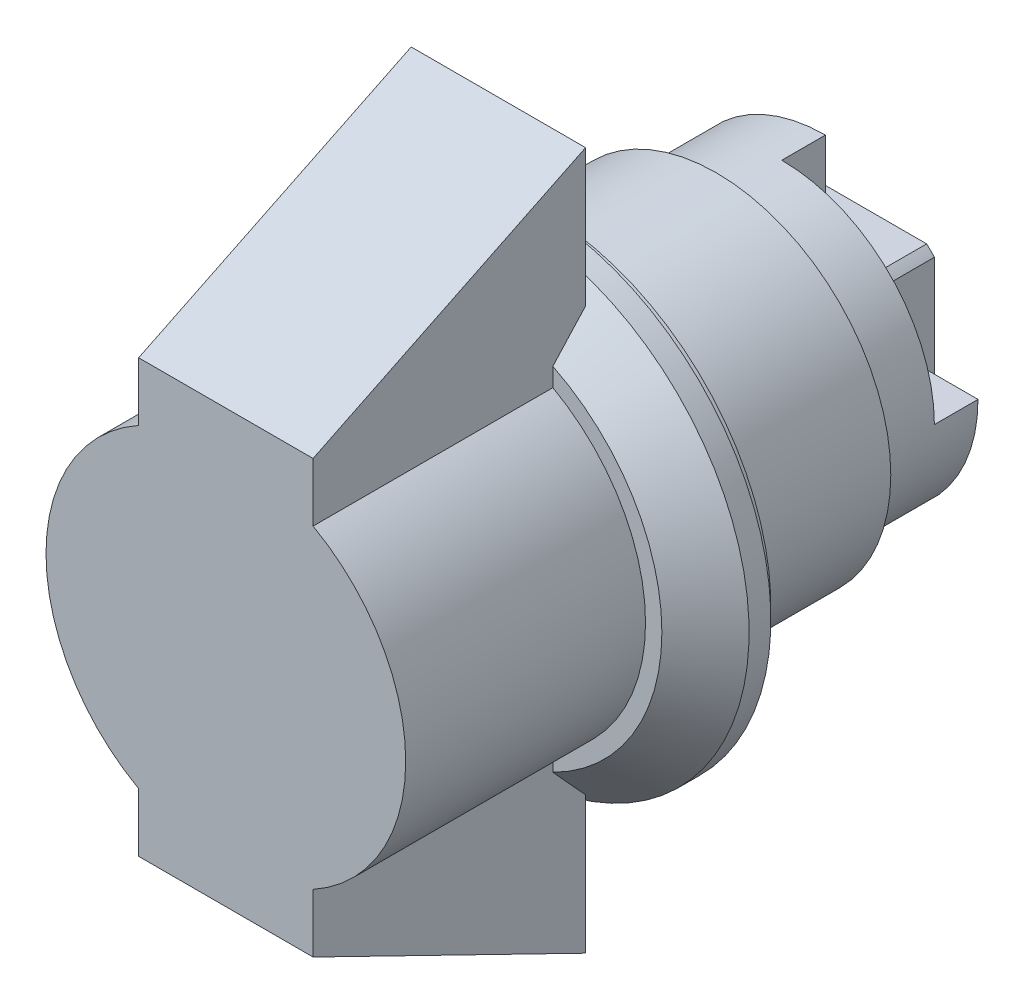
ISO-10303-21;
HEADER;
FILE_DESCRIPTION(('STEP AP214'),'2;1');
FILE_NAME('part.step','',(''),(''),'','','');
FILE_SCHEMA(('AUTOMOTIVE_DESIGN { 1 0 10303 214 1 1 1 1 }'));
ENDSEC;
DATA;
#1=APPLICATION_CONTEXT('core data for automotive mechanical design processes');
#2=APPLICATION_PROTOCOL_DEFINITION('international standard','automotive_design',2000,#1);
#3=PRODUCT_CONTEXT('',#1,'mechanical');
#4=PRODUCT('Part','Part','',(#3));
#5=PRODUCT_RELATED_PRODUCT_CATEGORY('part','',(#4));
#6=PRODUCT_DEFINITION_FORMATION('','',#4);
#7=PRODUCT_DEFINITION_CONTEXT('part definition',#1,'design');
#8=PRODUCT_DEFINITION('design','',#6,#7);
#9=PRODUCT_DEFINITION_SHAPE('','',#8);
#10=(LENGTH_UNIT() NAMED_UNIT(*) SI_UNIT(.MILLI.,.METRE.));
#11=(NAMED_UNIT(*) PLANE_ANGLE_UNIT() SI_UNIT($,.RADIAN.));
#12=(NAMED_UNIT(*) SI_UNIT($,.STERADIAN.) SOLID_ANGLE_UNIT());
#13=UNCERTAINTY_MEASURE_WITH_UNIT(LENGTH_MEASURE(1.E-05),#10,'distance_accuracy_value','');
#14=(GEOMETRIC_REPRESENTATION_CONTEXT(3) GLOBAL_UNCERTAINTY_ASSIGNED_CONTEXT((#13)) GLOBAL_UNIT_ASSIGNED_CONTEXT((#10,
#11,#12)) REPRESENTATION_CONTEXT('',''));
#15=CARTESIAN_POINT('',(0.,0.,0.));
#16=DIRECTION('',(0.,0.,1.));
#17=DIRECTION('',(1.,0.,0.));
#18=AXIS2_PLACEMENT_3D('',#15,#16,#17);
#19=CARTESIAN_POINT('',(0.,9.,3.5));
#20=DIRECTION('',(0.,0.,1.));
#21=DIRECTION('',(1.,0.,0.));
#22=AXIS2_PLACEMENT_3D('',#19,#20,#21);
#23=PLANE('',#22);
#24=CARTESIAN_POINT('',(0.,0.,3.5));
#25=DIRECTION('',(0.,0.,-1.));
#26=DIRECTION('',(-1.,0.,0.));
#27=AXIS2_PLACEMENT_3D('',#24,#25,#26);
#28=CIRCLE('',#27,9.);
#29=CARTESIAN_POINT('',(-4.,-8.06225774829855,3.5));
#30=VERTEX_POINT('',#29);
#31=CARTESIAN_POINT('',(-4.,8.06225774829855,3.5));
#32=VERTEX_POINT('',#31);
#33=EDGE_CURVE('E364',#30,#32,#28,.T.);
#34=ORIENTED_EDGE('',*,*,#33,.F.);
#35=DIRECTION('',(0.,1.,0.));
#36=VECTOR('',#35,1.);
#37=CARTESIAN_POINT('',(-4.,9.,3.5));
#38=LINE('',#37,#36);
#39=CARTESIAN_POINT('',(-4.,-7.21543484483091,3.5));
#40=VERTEX_POINT('',#39);
#41=EDGE_CURVE('E261',#30,#40,#38,.T.);
#42=ORIENTED_EDGE('',*,*,#41,.T.);
#43=CARTESIAN_POINT('',(0.,0.,3.5));
#44=DIRECTION('',(0.,0.,1.));
#45=DIRECTION('',(1.,0.,0.));
#46=AXIS2_PLACEMENT_3D('',#43,#44,#45);
#47=CIRCLE('',#46,8.25);
#48=CARTESIAN_POINT('',(-4.,7.21543484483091,3.5));
#49=VERTEX_POINT('',#48);
#50=EDGE_CURVE('E280',#49,#40,#47,.T.);
#51=ORIENTED_EDGE('',*,*,#50,.F.);
#52=EDGE_CURVE('E257',#49,#32,#38,.T.);
#53=ORIENTED_EDGE('',*,*,#52,.T.);
#54=EDGE_LOOP('',(#34,#42,#51,#53));
#55=FACE_BOUND('',#54,.T.);
#56=ADVANCED_FACE('F14',(#55),#23,.T.);
#57=CARTESIAN_POINT('',(0.,0.,1.5));
#58=DIRECTION('',(0.,0.,-1.));
#59=DIRECTION('',(-1.,0.,0.));
#60=AXIS2_PLACEMENT_3D('',#57,#58,#59);
#61=CONICAL_SURFACE('',#60,11.,0.785398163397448);
#62=CARTESIAN_POINT('',(0.,0.,1.5));
#63=DIRECTION('',(0.,0.,-1.));
#64=DIRECTION('',(-1.,0.,0.));
#65=AXIS2_PLACEMENT_3D('',#62,#63,#64);
#66=CIRCLE('',#65,11.);
#67=CARTESIAN_POINT('',(-11.,0.,1.5));
#68=VERTEX_POINT('',#67);
#69=EDGE_CURVE('E361',#68,#68,#66,.T.);
#70=ORIENTED_EDGE('',*,*,#69,.F.);
#71=EDGE_LOOP('',(#70));
#72=FACE_BOUND('',#71,.T.);
#73=CARTESIAN_POINT('',(0.,0.,2.));
#74=DIRECTION('',(0.,0.,1.));
#75=DIRECTION('',(1.,0.,0.));
#76=AXIS2_PLACEMENT_3D('',#73,#74,#75);
#77=CIRCLE('',#76,10.5);
#78=CARTESIAN_POINT('',(4.,-9.70824391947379,2.));
#79=VERTEX_POINT('',#78);
#80=CARTESIAN_POINT('',(-4.,-9.70824391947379,2.));
#81=VERTEX_POINT('',#80);
#82=EDGE_CURVE('E9',#79,#81,#77,.F.);
#83=ORIENTED_EDGE('',*,*,#82,.T.);
#84=CARTESIAN_POINT('',(-4.,-17.858105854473,-5.80059957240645));
#85=CARTESIAN_POINT('',(-4.,-17.5045819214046,-5.45563303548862));
#86=CARTESIAN_POINT('',(-4.,-17.1508222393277,-5.11090767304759));
#87=CARTESIAN_POINT('',(-4.,-16.4427152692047,-4.42205863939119));
#88=CARTESIAN_POINT('',(-4.,-16.0883679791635,-4.07793497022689));
#89=CARTESIAN_POINT('',(-4.,-15.3789386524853,-3.39037860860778));
#90=CARTESIAN_POINT('',(-4.,-15.0238565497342,-3.04694598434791));
#91=CARTESIAN_POINT('',(-4.,-14.3128340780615,-2.36097102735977));
#92=CARTESIAN_POINT('',(-4.,-13.9568937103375,-2.01842869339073));
#93=CARTESIAN_POINT('',(-4.,-13.2441762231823,-1.33467000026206));
#94=CARTESIAN_POINT('',(-4.,-12.8873997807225,-0.993452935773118));
#95=CARTESIAN_POINT('',(-4.,-12.1725099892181,-0.312422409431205));
#96=CARTESIAN_POINT('',(-4.,-11.8143966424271,0.0273910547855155));
#97=CARTESIAN_POINT('',(-4.,-11.0964623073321,0.705193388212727));
#98=CARTESIAN_POINT('',(-4.,-10.7366413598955,1.04318230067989));
#99=CARTESIAN_POINT('',(-4.,-10.0147552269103,1.71675339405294));
#100=CARTESIAN_POINT('',(-4.,-9.65269005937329,2.05233559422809));
#101=CARTESIAN_POINT('',(-4.,-9.01353072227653,2.63937643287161));
#102=CARTESIAN_POINT('',(-4.,-8.73708131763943,2.89153667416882));
#103=CARTESIAN_POINT('',(-4.,-8.18196173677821,3.393388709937));
#104=CARTESIAN_POINT('',(-4.,-7.90329163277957,3.64308058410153));
#105=CARTESIAN_POINT('',(-4.,-7.48306908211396,4.01518340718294));
#106=CARTESIAN_POINT('',(-4.,-7.34260789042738,4.13882693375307));
#107=CARTESIAN_POINT('',(-4.,-7.06084268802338,4.38514840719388));
#108=CARTESIAN_POINT('',(-4.,-6.91953868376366,4.50782636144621));
#109=CARTESIAN_POINT('',(-4.,-6.63594093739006,4.75206475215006));
#110=CARTESIAN_POINT('',(-4.,-6.49364709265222,4.87362506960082));
#111=CARTESIAN_POINT('',(-4.,-6.20790981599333,5.11539401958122));
#112=CARTESIAN_POINT('',(-4.,-6.06446635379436,5.23560261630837));
#113=CARTESIAN_POINT('',(-4.,-5.92036455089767,5.3550215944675));
#114=B_SPLINE_CURVE_WITH_KNOTS('',3,(#84,#85,#86,#87,#88,#89,#90,#91,#92,#93,#94,#95,#96,#97,
#98,#99,#100,#101,#102,#103,#104,#105,#106,#107,#108,#109,#110,#111,#112,#113),.UNSPECIFIED.,
.F.,.F.,(4,2,2,2,2,2,2,2,2,2,2,2,2,2,4),(0.,1.48183356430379,2.96367217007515,4.4456504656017,
5.92762669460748,7.4086594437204,8.88968969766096,10.3706846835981,11.8516677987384,
12.9741912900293,14.096678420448,14.65806033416,15.2194379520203,15.7808746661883,
16.342326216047),.UNSPECIFIED.);
#115=EDGE_CURVE('E270',#81,#30,#114,.T.);
#116=ORIENTED_EDGE('',*,*,#115,.T.);
#117=ORIENTED_EDGE('',*,*,#33,.T.);
#118=CARTESIAN_POINT('',(-4.,4.95832906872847,6.12936210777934));
#119=CARTESIAN_POINT('',(-4.,5.0787522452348,6.03562448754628));
#120=CARTESIAN_POINT('',(-4.,5.19853087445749,5.94106574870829));
#121=CARTESIAN_POINT('',(-4.,5.4369516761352,5.75053505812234));
#122=CARTESIAN_POINT('',(-4.,5.55559389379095,5.65456316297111));
#123=CARTESIAN_POINT('',(-4.,5.91001886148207,5.36489288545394));
#124=CARTESIAN_POINT('',(-4.,6.1443409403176,5.16940774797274));
#125=CARTESIAN_POINT('',(-4.,6.60990240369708,4.77500447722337));
#126=CARTESIAN_POINT('',(-4.,6.84114299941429,4.57608776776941));
#127=CARTESIAN_POINT('',(-4.,7.30130144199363,4.17556663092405));
#128=CARTESIAN_POINT('',(-4.,7.53021917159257,3.97396206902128));
#129=CARTESIAN_POINT('',(-4.,8.07664549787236,3.48829360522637));
#130=CARTESIAN_POINT('',(-4.,8.39327574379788,3.20324257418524));
#131=CARTESIAN_POINT('',(-4.,9.02386780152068,2.63020089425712));
#132=CARTESIAN_POINT('',(-4.,9.33782956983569,2.34221019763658));
#133=CARTESIAN_POINT('',(-4.,9.96372975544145,1.76400621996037));
#134=CARTESIAN_POINT('',(-4.,10.2756680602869,1.47379281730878));
#135=CARTESIAN_POINT('',(-4.,10.8979564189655,0.891667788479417));
#136=CARTESIAN_POINT('',(-4.,11.2083064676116,0.599756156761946));
#137=CARTESIAN_POINT('',(-4.,11.8281093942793,0.014254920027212));
#138=CARTESIAN_POINT('',(-4.,12.137560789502,-0.27933625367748));
#139=CARTESIAN_POINT('',(-4.,12.7554449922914,-0.867589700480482));
#140=CARTESIAN_POINT('',(-4.,13.0638777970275,-1.16225197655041));
#141=CARTESIAN_POINT('',(-4.,13.6798518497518,-1.75238711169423));
#142=CARTESIAN_POINT('',(-4.,13.9873932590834,-2.04785980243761));
#143=CARTESIAN_POINT('',(-4.,14.6017794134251,-2.63952462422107));
#144=CARTESIAN_POINT('',(-4.,14.9086241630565,-2.93571675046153));
#145=CARTESIAN_POINT('',(-4.,15.2151900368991,-3.23219653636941));
#146=B_SPLINE_CURVE_WITH_KNOTS('',3,(#118,#119,#120,#121,#122,#123,#124,#125,#126,#127,#128,
#129,#130,#131,#132,#133,#134,#135,#136,#137,#138,#139,#140,#141,#142,#143,#144,#145),
.UNSPECIFIED.,.F.,.F.,(4,2,2,2,2,2,2,2,2,2,2,2,2,4),(0.,0.457806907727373,0.915595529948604,
1.83101644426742,2.74606625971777,3.66116204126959,4.93925035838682,6.21735946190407,
7.49553899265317,8.77372269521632,10.0534083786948,11.3330976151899,12.6125386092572,
13.8919710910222),.UNSPECIFIED.);
#147=CARTESIAN_POINT('',(-4.,9.70824391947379,2.));
#148=VERTEX_POINT('',#147);
#149=EDGE_CURVE('E260',#32,#148,#146,.T.);
#150=ORIENTED_EDGE('',*,*,#149,.T.);
#151=CARTESIAN_POINT('',(4.,9.70824391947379,2.));
#152=VERTEX_POINT('',#151);
#153=EDGE_CURVE('E18',#148,#152,#77,.F.);
#154=ORIENTED_EDGE('',*,*,#153,.T.);
#155=CARTESIAN_POINT('',(4.,4.95832906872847,6.12936210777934));
#156=CARTESIAN_POINT('',(4.,5.0787522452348,6.03562448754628));
#157=CARTESIAN_POINT('',(4.,5.19853087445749,5.94106574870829));
#158=CARTESIAN_POINT('',(4.,5.4369516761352,5.75053505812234));
#159=CARTESIAN_POINT('',(4.,5.55559389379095,5.65456316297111));
#160=CARTESIAN_POINT('',(4.,5.91001886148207,5.36489288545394));
#161=CARTESIAN_POINT('',(4.,6.1443409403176,5.16940774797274));
#162=CARTESIAN_POINT('',(4.,6.60990240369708,4.77500447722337));
#163=CARTESIAN_POINT('',(4.,6.84114299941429,4.57608776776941));
#164=CARTESIAN_POINT('',(4.,7.30130144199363,4.17556663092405));
#165=CARTESIAN_POINT('',(4.,7.53021917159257,3.97396206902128));
#166=CARTESIAN_POINT('',(4.,8.07664549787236,3.48829360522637));
#167=CARTESIAN_POINT('',(4.,8.39327574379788,3.20324257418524));
#168=CARTESIAN_POINT('',(4.,9.02386780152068,2.63020089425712));
#169=CARTESIAN_POINT('',(4.,9.33782956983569,2.34221019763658));
#170=CARTESIAN_POINT('',(4.,9.96372975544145,1.76400621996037));
#171=CARTESIAN_POINT('',(4.,10.2756680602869,1.47379281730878));
#172=CARTESIAN_POINT('',(4.,10.8979564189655,0.891667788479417));
#173=CARTESIAN_POINT('',(4.,11.2083064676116,0.599756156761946));
#174=CARTESIAN_POINT('',(4.,11.8281093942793,0.014254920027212));
#175=CARTESIAN_POINT('',(4.,12.137560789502,-0.27933625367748));
#176=CARTESIAN_POINT('',(4.,12.7554449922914,-0.867589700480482));
#177=CARTESIAN_POINT('',(4.,13.0638777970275,-1.16225197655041));
#178=CARTESIAN_POINT('',(4.,13.6798518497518,-1.75238711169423));
#179=CARTESIAN_POINT('',(4.,13.9873932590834,-2.04785980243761));
#180=CARTESIAN_POINT('',(4.,14.6017794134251,-2.63952462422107));
#181=CARTESIAN_POINT('',(4.,14.9086241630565,-2.93571675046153));
#182=CARTESIAN_POINT('',(4.,15.2151900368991,-3.23219653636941));
#183=B_SPLINE_CURVE_WITH_KNOTS('',3,(#155,#156,#157,#158,#159,#160,#161,#162,#163,#164,#165,
#166,#167,#168,#169,#170,#171,#172,#173,#174,#175,#176,#177,#178,#179,#180,#181,#182),
.UNSPECIFIED.,.F.,.F.,(4,2,2,2,2,2,2,2,2,2,2,2,2,4),(0.,0.457806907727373,0.915595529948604,
1.83101644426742,2.74606625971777,3.66116204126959,4.93925035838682,6.21735946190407,
7.49553899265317,8.77372269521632,10.0534083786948,11.3330976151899,12.6125386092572,
13.8919710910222),.UNSPECIFIED.);
#184=CARTESIAN_POINT('',(4.,8.06225774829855,3.5));
#185=VERTEX_POINT('',#184);
#186=EDGE_CURVE('E226',#185,#152,#183,.T.);
#187=ORIENTED_EDGE('',*,*,#186,.F.);
#188=CARTESIAN_POINT('',(4.,-8.06225774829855,3.5));
#189=VERTEX_POINT('',#188);
#190=EDGE_CURVE('E367',#185,#189,#28,.T.);
#191=ORIENTED_EDGE('',*,*,#190,.T.);
#192=CARTESIAN_POINT('',(4.,-17.858105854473,-5.80059957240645));
#193=CARTESIAN_POINT('',(4.,-17.5045819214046,-5.45563303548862));
#194=CARTESIAN_POINT('',(4.,-17.1508222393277,-5.11090767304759));
#195=CARTESIAN_POINT('',(4.,-16.4427152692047,-4.42205863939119));
#196=CARTESIAN_POINT('',(4.,-16.0883679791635,-4.07793497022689));
#197=CARTESIAN_POINT('',(4.,-15.3789386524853,-3.39037860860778));
#198=CARTESIAN_POINT('',(4.,-15.0238565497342,-3.04694598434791));
#199=CARTESIAN_POINT('',(4.,-14.3128340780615,-2.36097102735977));
#200=CARTESIAN_POINT('',(4.,-13.9568937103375,-2.01842869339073));
#201=CARTESIAN_POINT('',(4.,-13.2441762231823,-1.33467000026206));
#202=CARTESIAN_POINT('',(4.,-12.8873997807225,-0.993452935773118));
#203=CARTESIAN_POINT('',(4.,-12.1725099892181,-0.312422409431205));
#204=CARTESIAN_POINT('',(4.,-11.8143966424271,0.0273910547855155));
#205=CARTESIAN_POINT('',(4.,-11.0964623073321,0.705193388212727));
#206=CARTESIAN_POINT('',(4.,-10.7366413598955,1.04318230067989));
#207=CARTESIAN_POINT('',(4.,-10.0147552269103,1.71675339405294));
#208=CARTESIAN_POINT('',(4.,-9.65269005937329,2.05233559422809));
#209=CARTESIAN_POINT('',(4.,-9.01353072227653,2.63937643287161));
#210=CARTESIAN_POINT('',(4.,-8.73708131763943,2.89153667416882));
#211=CARTESIAN_POINT('',(4.,-8.18196173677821,3.393388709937));
#212=CARTESIAN_POINT('',(4.,-7.90329163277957,3.64308058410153));
#213=CARTESIAN_POINT('',(4.,-7.48306908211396,4.01518340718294));
#214=CARTESIAN_POINT('',(4.,-7.34260789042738,4.13882693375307));
#215=CARTESIAN_POINT('',(4.,-7.06084268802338,4.38514840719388));
#216=CARTESIAN_POINT('',(4.,-6.91953868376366,4.50782636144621));
#217=CARTESIAN_POINT('',(4.,-6.63594093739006,4.75206475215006));
#218=CARTESIAN_POINT('',(4.,-6.49364709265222,4.87362506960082));
#219=CARTESIAN_POINT('',(4.,-6.20790981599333,5.11539401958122));
#220=CARTESIAN_POINT('',(4.,-6.06446635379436,5.23560261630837));
#221=CARTESIAN_POINT('',(4.,-5.92036455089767,5.3550215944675));
#222=B_SPLINE_CURVE_WITH_KNOTS('',3,(#192,#193,#194,#195,#196,#197,#198,#199,#200,#201,#202,
#203,#204,#205,#206,#207,#208,#209,#210,#211,#212,#213,#214,#215,#216,#217,#218,#219,#220,#221),
.UNSPECIFIED.,.F.,.F.,(4,2,2,2,2,2,2,2,2,2,2,2,2,2,4),(0.,1.48183356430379,2.96367217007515,
4.4456504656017,5.92762669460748,7.4086594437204,8.88968969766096,10.3706846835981,
11.8516677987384,12.9741912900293,14.096678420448,14.65806033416,15.2194379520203,
15.7808746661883,16.342326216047),.UNSPECIFIED.);
#223=EDGE_CURVE('E249',#79,#189,#222,.T.);
#224=ORIENTED_EDGE('',*,*,#223,.F.);
#225=EDGE_LOOP('',(#83,#116,#117,#150,#154,#187,#191,#224));
#226=FACE_BOUND('',#225,.T.);
#227=ADVANCED_FACE('F236',(#72,#226),#61,.T.);
#228=CARTESIAN_POINT('',(0.,0.,14.5));
#229=DIRECTION('',(0.,0.,-1.));
#230=DIRECTION('',(-1.,0.,0.));
#231=AXIS2_PLACEMENT_3D('',#228,#229,#230);
#232=CYLINDRICAL_SURFACE('',#231,8.25);
#233=DIRECTION('',(0.,0.,-1.));
#234=VECTOR('',#233,1.);
#235=CARTESIAN_POINT('',(-4.,-7.21543484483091,14.5));
#236=LINE('',#235,#234);
#237=CARTESIAN_POINT('',(-4.,-7.21543484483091,14.5));
#238=VERTEX_POINT('',#237);
#239=EDGE_CURVE('E268',#238,#40,#236,.T.);
#240=ORIENTED_EDGE('',*,*,#239,.F.);
#241=CARTESIAN_POINT('',(0.,0.,14.5));
#242=DIRECTION('',(0.,0.,1.));
#243=DIRECTION('',(1.,0.,0.));
#244=AXIS2_PLACEMENT_3D('',#241,#242,#243);
#245=CIRCLE('',#244,8.25);
#246=CARTESIAN_POINT('',(-4.,7.21543484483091,14.5));
#247=VERTEX_POINT('',#246);
#248=EDGE_CURVE('E283',#247,#238,#245,.T.);
#249=ORIENTED_EDGE('',*,*,#248,.F.);
#250=DIRECTION('',(0.,0.,-1.));
#251=VECTOR('',#250,1.);
#252=CARTESIAN_POINT('',(-4.,7.21543484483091,14.5));
#253=LINE('',#252,#251);
#254=EDGE_CURVE('E255',#49,#247,#253,.F.);
#255=ORIENTED_EDGE('',*,*,#254,.F.);
#256=ORIENTED_EDGE('',*,*,#50,.T.);
#257=EDGE_LOOP('',(#240,#249,#255,#256));
#258=FACE_BOUND('',#257,.T.);
#259=ADVANCED_FACE('F425',(#258),#232,.T.);
#260=CARTESIAN_POINT('',(0.,0.,-50.));
#261=DIRECTION('',(0.,0.,-1.));
#262=DIRECTION('',(-1.,0.,0.));
#263=AXIS2_PLACEMENT_3D('',#260,#261,#262);
#264=CYLINDRICAL_SURFACE('',#263,4.);
#265=DIRECTION('',(0.,0.,-1.));
#266=VECTOR('',#265,1.);
#267=CARTESIAN_POINT('',(-2.64575131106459,-3.,-7.61483519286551));
#268=LINE('',#267,#266);
#269=CARTESIAN_POINT('',(-2.64575131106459,-3.,-13.));
#270=VERTEX_POINT('',#269);
#271=CARTESIAN_POINT('',(-2.64575131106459,-3.,-15.));
#272=VERTEX_POINT('',#271);
#273=EDGE_CURVE('E318',#270,#272,#268,.T.);
#274=ORIENTED_EDGE('',*,*,#273,.F.);
#275=CARTESIAN_POINT('',(0.,0.,-13.));
#276=DIRECTION('',(0.,0.,-1.));
#277=DIRECTION('',(-1.,0.,0.));
#278=AXIS2_PLACEMENT_3D('',#275,#276,#277);
#279=CIRCLE('',#278,4.);
#280=CARTESIAN_POINT('',(-3.,-2.6457513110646,-13.));
#281=VERTEX_POINT('',#280);
#282=EDGE_CURVE('E378',#270,#281,#279,.T.);
#283=ORIENTED_EDGE('',*,*,#282,.T.);
#284=DIRECTION('',(0.,0.,-1.));
#285=VECTOR('',#284,1.);
#286=CARTESIAN_POINT('',(-3.,-2.6457513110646,-7.61483519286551));
#287=LINE('',#286,#285);
#288=CARTESIAN_POINT('',(-3.,-2.6457513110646,-15.));
#289=VERTEX_POINT('',#288);
#290=EDGE_CURVE('E343',#281,#289,#287,.T.);
#291=ORIENTED_EDGE('',*,*,#290,.T.);
#292=CARTESIAN_POINT('',(0.,0.,-15.));
#293=DIRECTION('',(0.,0.,-1.));
#294=DIRECTION('',(-1.,0.,0.));
#295=AXIS2_PLACEMENT_3D('',#292,#293,#294);
#296=CIRCLE('',#295,4.);
#297=EDGE_CURVE('E372',#272,#289,#296,.T.);
#298=ORIENTED_EDGE('',*,*,#297,.F.);
#299=EDGE_LOOP('',(#274,#283,#291,#298));
#300=FACE_BOUND('',#299,.T.);
#301=ADVANCED_FACE('F438',(#300),#264,.T.);
#302=DIRECTION('',(0.,0.,-1.));
#303=VECTOR('',#302,1.);
#304=CARTESIAN_POINT('',(2.64575131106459,-3.,-7.61483519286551));
#305=LINE('',#304,#303);
#306=CARTESIAN_POINT('',(2.64575131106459,-3.,-13.));
#307=VERTEX_POINT('',#306);
#308=CARTESIAN_POINT('',(2.64575131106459,-3.,-15.));
#309=VERTEX_POINT('',#308);
#310=EDGE_CURVE('E323',#307,#309,#305,.T.);
#311=ORIENTED_EDGE('',*,*,#310,.T.);
#312=CARTESIAN_POINT('',(3.,-2.64575131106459,-15.));
#313=VERTEX_POINT('',#312);
#314=EDGE_CURVE('E368',#313,#309,#296,.T.);
#315=ORIENTED_EDGE('',*,*,#314,.F.);
#316=DIRECTION('',(0.,0.,-1.));
#317=VECTOR('',#316,1.);
#318=CARTESIAN_POINT('',(3.,-2.64575131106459,-7.61483519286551));
#319=LINE('',#318,#317);
#320=CARTESIAN_POINT('',(3.,-2.64575131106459,-13.));
#321=VERTEX_POINT('',#320);
#322=EDGE_CURVE('E348',#321,#313,#319,.T.);
#323=ORIENTED_EDGE('',*,*,#322,.F.);
#324=EDGE_CURVE('E374',#321,#307,#279,.T.);
#325=ORIENTED_EDGE('',*,*,#324,.T.);
#326=EDGE_LOOP('',(#311,#315,#323,#325));
#327=FACE_BOUND('',#326,.T.);
#328=ADVANCED_FACE('F433',(#327),#264,.T.);
#329=CARTESIAN_POINT('',(0.,4.,-15.));
#330=DIRECTION('',(0.,0.,1.));
#331=DIRECTION('',(1.,0.,0.));
#332=AXIS2_PLACEMENT_3D('',#329,#330,#331);
#333=PLANE('',#332);
#334=CARTESIAN_POINT('',(0.,0.,-15.));
#335=DIRECTION('',(0.,0.,-1.));
#336=DIRECTION('',(-1.,0.,0.));
#337=AXIS2_PLACEMENT_3D('',#334,#335,#336);
#338=CIRCLE('',#337,2.5);
#339=CARTESIAN_POINT('',(-2.5,0.,-15.));
#340=VERTEX_POINT('',#339);
#341=EDGE_CURVE('E312',#340,#340,#338,.T.);
#342=ORIENTED_EDGE('',*,*,#341,.F.);
#343=EDGE_LOOP('',(#342));
#344=FACE_BOUND('',#343,.T.);
#345=DIRECTION('',(-1.,0.,0.));
#346=VECTOR('',#345,1.);
#347=CARTESIAN_POINT('',(2.64575131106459,-3.,-15.));
#348=LINE('',#347,#346);
#349=EDGE_CURVE('E319',#309,#272,#348,.T.);
#350=ORIENTED_EDGE('',*,*,#349,.T.);
#351=ORIENTED_EDGE('',*,*,#297,.T.);
#352=DIRECTION('',(0.,-1.,0.));
#353=VECTOR('',#352,1.);
#354=CARTESIAN_POINT('',(-3.,2.64575131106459,-15.));
#355=LINE('',#354,#353);
#356=CARTESIAN_POINT('',(-3.,2.64575131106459,-15.));
#357=VERTEX_POINT('',#356);
#358=EDGE_CURVE('E337',#357,#289,#355,.T.);
#359=ORIENTED_EDGE('',*,*,#358,.F.);
#360=CARTESIAN_POINT('',(-2.64575131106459,3.,-15.));
#361=VERTEX_POINT('',#360);
#362=EDGE_CURVE('E373',#357,#361,#296,.T.);
#363=ORIENTED_EDGE('',*,*,#362,.T.);
#364=DIRECTION('',(-1.,0.,0.));
#365=VECTOR('',#364,1.);
#366=CARTESIAN_POINT('',(2.64575131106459,3.,-15.));
#367=LINE('',#366,#365);
#368=CARTESIAN_POINT('',(2.64575131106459,3.,-15.));
#369=VERTEX_POINT('',#368);
#370=EDGE_CURVE('E325',#369,#361,#367,.T.);
#371=ORIENTED_EDGE('',*,*,#370,.F.);
#372=CARTESIAN_POINT('',(3.,2.64575131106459,-15.));
#373=VERTEX_POINT('',#372);
#374=EDGE_CURVE('E747',#369,#373,#296,.T.);
#375=ORIENTED_EDGE('',*,*,#374,.T.);
#376=DIRECTION('',(0.,-1.,0.));
#377=VECTOR('',#376,1.);
#378=CARTESIAN_POINT('',(3.,2.64575131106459,-15.));
#379=LINE('',#378,#377);
#380=EDGE_CURVE('E349',#373,#313,#379,.T.);
#381=ORIENTED_EDGE('',*,*,#380,.T.);
#382=ORIENTED_EDGE('',*,*,#314,.T.);
#383=EDGE_LOOP('',(#350,#351,#359,#363,#371,#375,#381,#382));
#384=FACE_BOUND('',#383,.T.);
#385=ADVANCED_FACE('F429',(#344,#384),#333,.F.);
#386=CARTESIAN_POINT('',(-3.,2.64575131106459,-13.));
#387=VERTEX_POINT('',#386);
#388=CARTESIAN_POINT('',(-2.64575131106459,3.,-13.));
#389=VERTEX_POINT('',#388);
#390=EDGE_CURVE('E371',#387,#389,#279,.T.);
#391=ORIENTED_EDGE('',*,*,#390,.T.);
#392=DIRECTION('',(0.,0.,-1.));
#393=VECTOR('',#392,1.);
#394=CARTESIAN_POINT('',(-2.64575131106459,3.,-7.61483519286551));
#395=LINE('',#394,#393);
#396=EDGE_CURVE('E332',#389,#361,#395,.T.);
#397=ORIENTED_EDGE('',*,*,#396,.T.);
#398=ORIENTED_EDGE('',*,*,#362,.F.);
#399=DIRECTION('',(0.,0.,-1.));
#400=VECTOR('',#399,1.);
#401=CARTESIAN_POINT('',(-3.,2.64575131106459,-7.61483519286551));
#402=LINE('',#401,#400);
#403=EDGE_CURVE('E346',#387,#357,#402,.T.);
#404=ORIENTED_EDGE('',*,*,#403,.F.);
#405=EDGE_LOOP('',(#391,#397,#398,#404));
#406=FACE_BOUND('',#405,.T.);
#407=ADVANCED_FACE('F432',(#406),#264,.T.);
#408=ORIENTED_EDGE('',*,*,#374,.F.);
#409=DIRECTION('',(0.,0.,-1.));
#410=VECTOR('',#409,1.);
#411=CARTESIAN_POINT('',(2.64575131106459,3.,-7.61483519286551));
#412=LINE('',#411,#410);
#413=CARTESIAN_POINT('',(2.64575131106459,3.,-13.));
#414=VERTEX_POINT('',#413);
#415=EDGE_CURVE('E335',#414,#369,#412,.T.);
#416=ORIENTED_EDGE('',*,*,#415,.F.);
#417=CARTESIAN_POINT('',(0.,0.,-13.));
#418=DIRECTION('',(0.,0.,-1.));
#419=DIRECTION('',(-1.,0.,0.));
#420=AXIS2_PLACEMENT_3D('',#417,#418,#419);
#421=CIRCLE('',#420,4.);
#422=CARTESIAN_POINT('',(0.,4.,-13.));
#423=VERTEX_POINT('',#422);
#424=EDGE_CURVE('E288',#423,#414,#421,.T.);
#425=ORIENTED_EDGE('',*,*,#424,.F.);
#426=DIRECTION('',(0.,0.,-1.));
#427=VECTOR('',#426,1.);
#428=CARTESIAN_POINT('',(0.,4.,-11.));
#429=LINE('',#428,#427);
#430=CARTESIAN_POINT('',(0.,4.,-11.));
#431=VERTEX_POINT('',#430);
#432=EDGE_CURVE('E307',#431,#423,#429,.T.);
#433=ORIENTED_EDGE('',*,*,#432,.F.);
#434=CARTESIAN_POINT('',(0.,0.,-11.));
#435=DIRECTION('',(0.,0.,-1.));
#436=DIRECTION('',(-1.,0.,0.));
#437=AXIS2_PLACEMENT_3D('',#434,#435,#436);
#438=CIRCLE('',#437,4.);
#439=CARTESIAN_POINT('',(4.,0.,-11.));
#440=VERTEX_POINT('',#439);
#441=EDGE_CURVE('E297',#431,#440,#438,.T.);
#442=ORIENTED_EDGE('',*,*,#441,.T.);
#443=DIRECTION('',(0.,0.,-1.));
#444=VECTOR('',#443,1.);
#445=CARTESIAN_POINT('',(4.,0.,-11.));
#446=LINE('',#445,#444);
#447=CARTESIAN_POINT('',(4.,0.,-13.));
#448=VERTEX_POINT('',#447);
#449=EDGE_CURVE('E305',#440,#448,#446,.T.);
#450=ORIENTED_EDGE('',*,*,#449,.T.);
#451=CARTESIAN_POINT('',(3.,2.64575131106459,-13.));
#452=VERTEX_POINT('',#451);
#453=EDGE_CURVE('E287',#452,#448,#421,.T.);
#454=ORIENTED_EDGE('',*,*,#453,.F.);
#455=DIRECTION('',(0.,0.,-1.));
#456=VECTOR('',#455,1.);
#457=CARTESIAN_POINT('',(3.,2.64575131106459,-7.61483519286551));
#458=LINE('',#457,#456);
#459=EDGE_CURVE('E353',#452,#373,#458,.T.);
#460=ORIENTED_EDGE('',*,*,#459,.T.);
#461=EDGE_LOOP('',(#408,#416,#425,#433,#442,#450,#454,#460));
#462=FACE_BOUND('',#461,.T.);
#463=ADVANCED_FACE('F400',(#462),#264,.T.);
#464=CARTESIAN_POINT('',(0.,11.,0.5));
#465=DIRECTION('',(0.,0.,1.));
#466=DIRECTION('',(1.,0.,0.));
#467=AXIS2_PLACEMENT_3D('',#464,#465,#466);
#468=PLANE('',#467);
#469=CARTESIAN_POINT('',(0.,0.,0.5));
#470=DIRECTION('',(0.,0.,-1.));
#471=DIRECTION('',(-1.,0.,0.));
#472=AXIS2_PLACEMENT_3D('',#469,#470,#471);
#473=CIRCLE('',#472,10.5);
#474=CARTESIAN_POINT('',(-10.5,0.,0.5));
#475=VERTEX_POINT('',#474);
#476=EDGE_CURVE('E281',#475,#475,#473,.T.);
#477=ORIENTED_EDGE('',*,*,#476,.F.);
#478=EDGE_LOOP('',(#477));
#479=FACE_BOUND('',#478,.T.);
#480=CARTESIAN_POINT('',(0.,0.,0.5));
#481=DIRECTION('',(0.,0.,-1.));
#482=DIRECTION('',(-1.,0.,0.));
#483=AXIS2_PLACEMENT_3D('',#480,#481,#482);
#484=CIRCLE('',#483,11.);
#485=CARTESIAN_POINT('',(-11.,0.,0.5));
#486=VERTEX_POINT('',#485);
#487=EDGE_CURVE('E355',#486,#486,#484,.T.);
#488=ORIENTED_EDGE('',*,*,#487,.T.);
#489=EDGE_LOOP('',(#488));
#490=FACE_BOUND('',#489,.T.);
#491=ADVANCED_FACE('F16',(#479,#490),#468,.F.);
#492=CARTESIAN_POINT('',(0.,0.,-50.));
#493=DIRECTION('',(0.,0.,-1.));
#494=DIRECTION('',(-1.,0.,0.));
#495=AXIS2_PLACEMENT_3D('',#492,#493,#494);
#496=CYLINDRICAL_SURFACE('',#495,10.5);
#497=ORIENTED_EDGE('',*,*,#476,.T.);
#498=EDGE_LOOP('',(#497));
#499=FACE_BOUND('',#498,.T.);
#500=CARTESIAN_POINT('',(0.,0.,0.));
#501=DIRECTION('',(0.,0.,-1.));
#502=DIRECTION('',(-1.,0.,0.));
#503=AXIS2_PLACEMENT_3D('',#500,#501,#502);
#504=CIRCLE('',#503,10.5);
#505=CARTESIAN_POINT('',(-10.5,0.,0.));
#506=VERTEX_POINT('',#505);
#507=EDGE_CURVE('E390',#506,#506,#504,.T.);
#508=ORIENTED_EDGE('',*,*,#507,.F.);
#509=EDGE_LOOP('',(#508));
#510=FACE_BOUND('',#509,.T.);
#511=ADVANCED_FACE('F395',(#499,#510),#496,.T.);
#512=CARTESIAN_POINT('',(0.,10.5,0.));
#513=DIRECTION('',(0.,0.,1.));
#514=DIRECTION('',(1.,0.,0.));
#515=AXIS2_PLACEMENT_3D('',#512,#513,#514);
#516=PLANE('',#515);
#517=CARTESIAN_POINT('',(0.,0.,0.));
#518=DIRECTION('',(0.,0.,-1.));
#519=DIRECTION('',(-1.,0.,0.));
#520=AXIS2_PLACEMENT_3D('',#517,#518,#519);
#521=CIRCLE('',#520,8.);
#522=CARTESIAN_POINT('',(-8.,0.,0.));
#523=VERTEX_POINT('',#522);
#524=EDGE_CURVE('E387',#523,#523,#521,.T.);
#525=ORIENTED_EDGE('',*,*,#524,.F.);
#526=EDGE_LOOP('',(#525));
#527=FACE_BOUND('',#526,.T.);
#528=ORIENTED_EDGE('',*,*,#507,.T.);
#529=EDGE_LOOP('',(#528));
#530=FACE_BOUND('',#529,.T.);
#531=ADVANCED_FACE('F453',(#527,#530),#516,.F.);
#532=CARTESIAN_POINT('',(0.,0.,-50.));
#533=DIRECTION('',(0.,0.,-1.));
#534=DIRECTION('',(-1.,0.,0.));
#535=AXIS2_PLACEMENT_3D('',#532,#533,#534);
#536=CYLINDRICAL_SURFACE('',#535,8.);
#537=ORIENTED_EDGE('',*,*,#524,.T.);
#538=EDGE_LOOP('',(#537));
#539=FACE_BOUND('',#538,.T.);
#540=CARTESIAN_POINT('',(0.,0.,-8.));
#541=DIRECTION('',(0.,0.,-1.));
#542=DIRECTION('',(-1.,0.,0.));
#543=AXIS2_PLACEMENT_3D('',#540,#541,#542);
#544=CIRCLE('',#543,8.);
#545=CARTESIAN_POINT('',(-8.,0.,-8.));
#546=VERTEX_POINT('',#545);
#547=EDGE_CURVE('E384',#546,#546,#544,.T.);
#548=ORIENTED_EDGE('',*,*,#547,.F.);
#549=EDGE_LOOP('',(#548));
#550=FACE_BOUND('',#549,.T.);
#551=ADVANCED_FACE('F449',(#539,#550),#536,.T.);
#552=CARTESIAN_POINT('',(0.,8.,-8.));
#553=DIRECTION('',(0.,0.,1.));
#554=DIRECTION('',(1.,0.,0.));
#555=AXIS2_PLACEMENT_3D('',#552,#553,#554);
#556=PLANE('',#555);
#557=CARTESIAN_POINT('',(0.,0.,-8.));
#558=DIRECTION('',(0.,0.,-1.));
#559=DIRECTION('',(-1.,0.,0.));
#560=AXIS2_PLACEMENT_3D('',#557,#558,#559);
#561=CIRCLE('',#560,7.);
#562=CARTESIAN_POINT('',(-7.,0.,-8.));
#563=VERTEX_POINT('',#562);
#564=EDGE_CURVE('E381',#563,#563,#561,.T.);
#565=ORIENTED_EDGE('',*,*,#564,.F.);
#566=EDGE_LOOP('',(#565));
#567=FACE_BOUND('',#566,.T.);
#568=ORIENTED_EDGE('',*,*,#547,.T.);
#569=EDGE_LOOP('',(#568));
#570=FACE_BOUND('',#569,.T.);
#571=ADVANCED_FACE('F445',(#567,#570),#556,.F.);
#572=CARTESIAN_POINT('',(0.,0.,-50.));
#573=DIRECTION('',(0.,0.,-1.));
#574=DIRECTION('',(-1.,0.,0.));
#575=AXIS2_PLACEMENT_3D('',#572,#573,#574);
#576=CYLINDRICAL_SURFACE('',#575,7.);
#577=CARTESIAN_POINT('',(0.,0.,-11.));
#578=DIRECTION('',(0.,0.,-1.));
#579=DIRECTION('',(-1.,0.,0.));
#580=AXIS2_PLACEMENT_3D('',#577,#578,#579);
#581=CIRCLE('',#580,7.);
#582=CARTESIAN_POINT('',(0.,7.,-11.));
#583=VERTEX_POINT('',#582);
#584=CARTESIAN_POINT('',(7.,0.,-11.));
#585=VERTEX_POINT('',#584);
#586=EDGE_CURVE('E292',#583,#585,#581,.T.);
#587=ORIENTED_EDGE('',*,*,#586,.F.);
#588=DIRECTION('',(0.,0.,-1.));
#589=VECTOR('',#588,1.);
#590=CARTESIAN_POINT('',(0.,7.,-11.));
#591=LINE('',#590,#589);
#592=CARTESIAN_POINT('',(0.,7.,-13.));
#593=VERTEX_POINT('',#592);
#594=EDGE_CURVE('E309',#583,#593,#591,.T.);
#595=ORIENTED_EDGE('',*,*,#594,.T.);
#596=CARTESIAN_POINT('',(0.,0.,-13.));
#597=DIRECTION('',(0.,0.,-1.));
#598=DIRECTION('',(-1.,0.,0.));
#599=AXIS2_PLACEMENT_3D('',#596,#597,#598);
#600=CIRCLE('',#599,7.);
#601=CARTESIAN_POINT('',(7.,0.,-13.));
#602=VERTEX_POINT('',#601);
#603=EDGE_CURVE('E377',#602,#593,#600,.T.);
#604=ORIENTED_EDGE('',*,*,#603,.F.);
#605=DIRECTION('',(0.,0.,-1.));
#606=VECTOR('',#605,1.);
#607=CARTESIAN_POINT('',(7.,0.,-11.));
#608=LINE('',#607,#606);
#609=EDGE_CURVE('E303',#585,#602,#608,.T.);
#610=ORIENTED_EDGE('',*,*,#609,.F.);
#611=EDGE_LOOP('',(#587,#595,#604,#610));
#612=FACE_BOUND('',#611,.T.);
#613=ORIENTED_EDGE('',*,*,#564,.T.);
#614=EDGE_LOOP('',(#613));
#615=FACE_BOUND('',#614,.T.);
#616=ADVANCED_FACE('F441',(#612,#615),#576,.T.);
#617=CARTESIAN_POINT('',(0.,7.,-13.));
#618=DIRECTION('',(0.,0.,1.));
#619=DIRECTION('',(1.,0.,0.));
#620=AXIS2_PLACEMENT_3D('',#617,#618,#619);
#621=PLANE('',#620);
#622=ORIENTED_EDGE('',*,*,#603,.T.);
#623=DIRECTION('',(0.,1.,0.));
#624=VECTOR('',#623,1.);
#625=CARTESIAN_POINT('',(0.,4.,-13.));
#626=LINE('',#625,#624);
#627=EDGE_CURVE('E290',#423,#593,#626,.T.);
#628=ORIENTED_EDGE('',*,*,#627,.F.);
#629=ORIENTED_EDGE('',*,*,#424,.T.);
#630=DIRECTION('',(-1.,0.,0.));
#631=VECTOR('',#630,1.);
#632=CARTESIAN_POINT('',(2.64575131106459,3.,-13.));
#633=LINE('',#632,#631);
#634=EDGE_CURVE('E330',#414,#389,#633,.T.);
#635=ORIENTED_EDGE('',*,*,#634,.T.);
#636=ORIENTED_EDGE('',*,*,#390,.F.);
#637=DIRECTION('',(0.,-1.,0.));
#638=VECTOR('',#637,1.);
#639=CARTESIAN_POINT('',(-3.,2.64575131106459,-13.));
#640=LINE('',#639,#638);
#641=EDGE_CURVE('E340',#387,#281,#640,.T.);
#642=ORIENTED_EDGE('',*,*,#641,.T.);
#643=ORIENTED_EDGE('',*,*,#282,.F.);
#644=DIRECTION('',(-1.,0.,0.));
#645=VECTOR('',#644,1.);
#646=CARTESIAN_POINT('',(2.64575131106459,-3.,-13.));
#647=LINE('',#646,#645);
#648=EDGE_CURVE('E322',#307,#270,#647,.T.);
#649=ORIENTED_EDGE('',*,*,#648,.F.);
#650=ORIENTED_EDGE('',*,*,#324,.F.);
#651=DIRECTION('',(0.,-1.,0.));
#652=VECTOR('',#651,1.);
#653=CARTESIAN_POINT('',(3.,2.64575131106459,-13.));
#654=LINE('',#653,#652);
#655=EDGE_CURVE('E352',#452,#321,#654,.T.);
#656=ORIENTED_EDGE('',*,*,#655,.F.);
#657=ORIENTED_EDGE('',*,*,#453,.T.);
#658=DIRECTION('',(1.,0.,0.));
#659=VECTOR('',#658,1.);
#660=CARTESIAN_POINT('',(4.,0.,-13.));
#661=LINE('',#660,#659);
#662=EDGE_CURVE('E284',#448,#602,#661,.T.);
#663=ORIENTED_EDGE('',*,*,#662,.T.);
#664=EDGE_LOOP('',(#622,#628,#629,#635,#636,#642,#643,#649,#650,#656,#657,#663));
#665=FACE_BOUND('',#664,.T.);
#666=ADVANCED_FACE('F417',(#665),#621,.F.);
#667=DIRECTION('',(0.,1.,0.));
#668=VECTOR('',#667,1.);
#669=CARTESIAN_POINT('',(4.,9.,3.5));
#670=LINE('',#669,#668);
#671=CARTESIAN_POINT('',(4.,-7.21543484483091,3.5));
#672=VERTEX_POINT('',#671);
#673=EDGE_CURVE('E29',#189,#672,#670,.T.);
#674=ORIENTED_EDGE('',*,*,#673,.F.);
#675=ORIENTED_EDGE('',*,*,#190,.F.);
#676=CARTESIAN_POINT('',(4.,7.21543484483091,3.5));
#677=VERTEX_POINT('',#676);
#678=EDGE_CURVE('E224',#677,#185,#670,.T.);
#679=ORIENTED_EDGE('',*,*,#678,.F.);
#680=EDGE_CURVE('E277',#672,#677,#47,.T.);
#681=ORIENTED_EDGE('',*,*,#680,.F.);
#682=EDGE_LOOP('',(#674,#675,#679,#681));
#683=FACE_BOUND('',#682,.T.);
#684=ADVANCED_FACE('F406',(#683),#23,.T.);
#685=CARTESIAN_POINT('',(0.,0.,-50.));
#686=DIRECTION('',(0.,0.,-1.));
#687=DIRECTION('',(-1.,0.,0.));
#688=AXIS2_PLACEMENT_3D('',#685,#686,#687);
#689=CYLINDRICAL_SURFACE('',#688,11.);
#690=ORIENTED_EDGE('',*,*,#69,.T.);
#691=EDGE_LOOP('',(#690));
#692=FACE_BOUND('',#691,.T.);
#693=ORIENTED_EDGE('',*,*,#487,.F.);
#694=EDGE_LOOP('',(#693));
#695=FACE_BOUND('',#694,.T.);
#696=ADVANCED_FACE('F403',(#692,#695),#689,.T.);
#697=CARTESIAN_POINT('',(3.,2.64575131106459,-7.61483519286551));
#698=DIRECTION('',(1.,0.,0.));
#699=DIRECTION('',(0.,1.,0.));
#700=AXIS2_PLACEMENT_3D('',#697,#698,#699);
#701=PLANE('',#700);
#702=ORIENTED_EDGE('',*,*,#655,.T.);
#703=ORIENTED_EDGE('',*,*,#322,.T.);
#704=ORIENTED_EDGE('',*,*,#380,.F.);
#705=ORIENTED_EDGE('',*,*,#459,.F.);
#706=EDGE_LOOP('',(#702,#703,#704,#705));
#707=FACE_BOUND('',#706,.T.);
#708=ADVANCED_FACE('F405',(#707),#701,.T.);
#709=CARTESIAN_POINT('',(-3.,2.64575131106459,-7.61483519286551));
#710=DIRECTION('',(1.,0.,0.));
#711=DIRECTION('',(0.,1.,0.));
#712=AXIS2_PLACEMENT_3D('',#709,#710,#711);
#713=PLANE('',#712);
#714=ORIENTED_EDGE('',*,*,#403,.T.);
#715=ORIENTED_EDGE('',*,*,#358,.T.);
#716=ORIENTED_EDGE('',*,*,#290,.F.);
#717=ORIENTED_EDGE('',*,*,#641,.F.);
#718=EDGE_LOOP('',(#714,#715,#716,#717));
#719=FACE_BOUND('',#718,.T.);
#720=ADVANCED_FACE('F414',(#719),#713,.F.);
#721=CARTESIAN_POINT('',(2.64575131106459,3.,-7.61483519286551));
#722=DIRECTION('',(0.,-1.,0.));
#723=DIRECTION('',(1.,0.,0.));
#724=AXIS2_PLACEMENT_3D('',#721,#722,#723);
#725=PLANE('',#724);
#726=ORIENTED_EDGE('',*,*,#415,.T.);
#727=ORIENTED_EDGE('',*,*,#370,.T.);
#728=ORIENTED_EDGE('',*,*,#396,.F.);
#729=ORIENTED_EDGE('',*,*,#634,.F.);
#730=EDGE_LOOP('',(#726,#727,#728,#729));
#731=FACE_BOUND('',#730,.T.);
#732=ADVANCED_FACE('F695',(#731),#725,.F.);
#733=CARTESIAN_POINT('',(2.64575131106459,-3.,-7.61483519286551));
#734=DIRECTION('',(0.,-1.,0.));
#735=DIRECTION('',(1.,0.,0.));
#736=AXIS2_PLACEMENT_3D('',#733,#734,#735);
#737=PLANE('',#736);
#738=ORIENTED_EDGE('',*,*,#648,.T.);
#739=ORIENTED_EDGE('',*,*,#273,.T.);
#740=ORIENTED_EDGE('',*,*,#349,.F.);
#741=ORIENTED_EDGE('',*,*,#310,.F.);
#742=EDGE_LOOP('',(#738,#739,#740,#741));
#743=FACE_BOUND('',#742,.T.);
#744=ADVANCED_FACE('F678',(#743),#737,.T.);
#745=CARTESIAN_POINT('',(0.,0.,-7.));
#746=DIRECTION('',(0.,0.,-1.));
#747=DIRECTION('',(-1.,0.,0.));
#748=AXIS2_PLACEMENT_3D('',#745,#746,#747);
#749=CYLINDRICAL_SURFACE('',#748,2.5);
#750=CARTESIAN_POINT('',(0.,0.,-7.));
#751=DIRECTION('',(0.,0.,-1.));
#752=DIRECTION('',(-1.,0.,0.));
#753=AXIS2_PLACEMENT_3D('',#750,#751,#752);
#754=CIRCLE('',#753,2.5);
#755=CARTESIAN_POINT('',(-2.5,0.,-7.));
#756=VERTEX_POINT('',#755);
#757=EDGE_CURVE('E315',#756,#756,#754,.T.);
#758=ORIENTED_EDGE('',*,*,#757,.F.);
#759=EDGE_LOOP('',(#758));
#760=FACE_BOUND('',#759,.T.);
#761=ORIENTED_EDGE('',*,*,#341,.T.);
#762=EDGE_LOOP('',(#761));
#763=FACE_BOUND('',#762,.T.);
#764=ADVANCED_FACE('F668',(#760,#763),#749,.F.);
#765=CARTESIAN_POINT('',(0.,0.,-7.));
#766=DIRECTION('',(0.,0.,-1.));
#767=DIRECTION('',(-1.,0.,0.));
#768=AXIS2_PLACEMENT_3D('',#765,#766,#767);
#769=PLANE('',#768);
#770=ORIENTED_EDGE('',*,*,#757,.T.);
#771=EDGE_LOOP('',(#770));
#772=FACE_BOUND('',#771,.T.);
#773=ADVANCED_FACE('F665',(#772),#769,.T.);
#774=CARTESIAN_POINT('',(0.,4.,-11.));
#775=DIRECTION('',(-1.,0.,0.));
#776=DIRECTION('',(0.,0.,1.));
#777=AXIS2_PLACEMENT_3D('',#774,#775,#776);
#778=PLANE('',#777);
#779=ORIENTED_EDGE('',*,*,#432,.T.);
#780=ORIENTED_EDGE('',*,*,#627,.T.);
#781=ORIENTED_EDGE('',*,*,#594,.F.);
#782=DIRECTION('',(0.,1.,0.));
#783=VECTOR('',#782,1.);
#784=CARTESIAN_POINT('',(0.,4.,-11.));
#785=LINE('',#784,#783);
#786=EDGE_CURVE('E300',#431,#583,#785,.T.);
#787=ORIENTED_EDGE('',*,*,#786,.F.);
#788=EDGE_LOOP('',(#779,#780,#781,#787));
#789=FACE_BOUND('',#788,.T.);
#790=ADVANCED_FACE('F648',(#789),#778,.F.);
#791=CARTESIAN_POINT('',(4.,0.,-11.));
#792=DIRECTION('',(0.,1.,0.));
#793=DIRECTION('',(-1.,0.,0.));
#794=AXIS2_PLACEMENT_3D('',#791,#792,#793);
#795=PLANE('',#794);
#796=DIRECTION('',(1.,0.,0.));
#797=VECTOR('',#796,1.);
#798=CARTESIAN_POINT('',(4.,0.,-11.));
#799=LINE('',#798,#797);
#800=EDGE_CURVE('E294',#440,#585,#799,.T.);
#801=ORIENTED_EDGE('',*,*,#800,.T.);
#802=ORIENTED_EDGE('',*,*,#609,.T.);
#803=ORIENTED_EDGE('',*,*,#662,.F.);
#804=ORIENTED_EDGE('',*,*,#449,.F.);
#805=EDGE_LOOP('',(#801,#802,#803,#804));
#806=FACE_BOUND('',#805,.T.);
#807=ADVANCED_FACE('F629',(#806),#795,.T.);
#808=CARTESIAN_POINT('',(0.,0.,-11.));
#809=DIRECTION('',(0.,0.,-1.));
#810=DIRECTION('',(-1.,0.,0.));
#811=AXIS2_PLACEMENT_3D('',#808,#809,#810);
#812=PLANE('',#811);
#813=ORIENTED_EDGE('',*,*,#586,.T.);
#814=ORIENTED_EDGE('',*,*,#800,.F.);
#815=ORIENTED_EDGE('',*,*,#441,.F.);
#816=ORIENTED_EDGE('',*,*,#786,.T.);
#817=EDGE_LOOP('',(#813,#814,#815,#816));
#818=FACE_BOUND('',#817,.T.);
#819=ADVANCED_FACE('F637',(#818),#812,.T.);
#820=CARTESIAN_POINT('',(4.,-7.21543484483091,14.5));
#821=VERTEX_POINT('',#820);
#822=CARTESIAN_POINT('',(4.,7.21543484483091,14.5));
#823=VERTEX_POINT('',#822);
#824=EDGE_CURVE('E197',#821,#823,#245,.T.);
#825=ORIENTED_EDGE('',*,*,#824,.F.);
#826=DIRECTION('',(0.,0.,-1.));
#827=VECTOR('',#826,1.);
#828=CARTESIAN_POINT('',(4.,-7.21543484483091,14.5));
#829=LINE('',#828,#827);
#830=EDGE_CURVE('E234',#821,#672,#829,.T.);
#831=ORIENTED_EDGE('',*,*,#830,.T.);
#832=ORIENTED_EDGE('',*,*,#680,.T.);
#833=DIRECTION('',(0.,0.,-1.));
#834=VECTOR('',#833,1.);
#835=CARTESIAN_POINT('',(4.,7.21543484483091,14.5));
#836=LINE('',#835,#834);
#837=EDGE_CURVE('E222',#677,#823,#836,.F.);
#838=ORIENTED_EDGE('',*,*,#837,.T.);
#839=EDGE_LOOP('',(#825,#831,#832,#838));
#840=FACE_BOUND('',#839,.T.);
#841=ADVANCED_FACE('F551',(#840),#232,.T.);
#842=CARTESIAN_POINT('',(0.,0.,14.5));
#843=DIRECTION('',(0.,0.,1.));
#844=DIRECTION('',(1.,0.,0.));
#845=AXIS2_PLACEMENT_3D('',#842,#843,#844);
#846=PLANE('',#845);
#847=ORIENTED_EDGE('',*,*,#824,.T.);
#848=DIRECTION('',(0.,-1.,0.));
#849=VECTOR('',#848,1.);
#850=CARTESIAN_POINT('',(4.,9.90334264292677,14.5));
#851=LINE('',#850,#849);
#852=CARTESIAN_POINT('',(4.,9.90334264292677,14.5));
#853=VERTEX_POINT('',#852);
#854=EDGE_CURVE('E37',#853,#823,#851,.T.);
#855=ORIENTED_EDGE('',*,*,#854,.F.);
#856=DIRECTION('',(1.,0.,0.));
#857=VECTOR('',#856,1.);
#858=CARTESIAN_POINT('',(-4.,9.90334264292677,14.5));
#859=LINE('',#858,#857);
#860=CARTESIAN_POINT('',(-4.,9.90334264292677,14.5));
#861=VERTEX_POINT('',#860);
#862=EDGE_CURVE('E176',#861,#853,#859,.T.);
#863=ORIENTED_EDGE('',*,*,#862,.F.);
#864=DIRECTION('',(0.,-1.,0.));
#865=VECTOR('',#864,1.);
#866=CARTESIAN_POINT('',(-4.,9.90334264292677,14.5));
#867=LINE('',#866,#865);
#868=EDGE_CURVE('E207',#861,#247,#867,.T.);
#869=ORIENTED_EDGE('',*,*,#868,.T.);
#870=ORIENTED_EDGE('',*,*,#248,.T.);
#871=CARTESIAN_POINT('',(-4.,-9.90334264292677,14.5));
#872=VERTEX_POINT('',#871);
#873=EDGE_CURVE('E206',#238,#872,#867,.T.);
#874=ORIENTED_EDGE('',*,*,#873,.T.);
#875=DIRECTION('',(1.,0.,0.));
#876=VECTOR('',#875,1.);
#877=CARTESIAN_POINT('',(-4.,-9.90334264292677,14.5));
#878=LINE('',#877,#876);
#879=CARTESIAN_POINT('',(4.,-9.90334264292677,14.5));
#880=VERTEX_POINT('',#879);
#881=EDGE_CURVE('E185',#872,#880,#878,.T.);
#882=ORIENTED_EDGE('',*,*,#881,.T.);
#883=EDGE_CURVE('E191',#821,#880,#851,.T.);
#884=ORIENTED_EDGE('',*,*,#883,.F.);
#885=EDGE_LOOP('',(#847,#855,#863,#869,#870,#874,#882,#884));
#886=FACE_BOUND('',#885,.T.);
#887=ADVANCED_FACE('F194',(#886),#846,.T.);
#888=CARTESIAN_POINT('',(-4.,16.,2.));
#889=DIRECTION('',(0.,0.898794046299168,0.438371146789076));
#890=DIRECTION('',(0.,0.438371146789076,-0.898794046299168));
#891=AXIS2_PLACEMENT_3D('',#888,#889,#890);
#892=PLANE('',#891);
#893=DIRECTION('',(1.,0.,0.));
#894=VECTOR('',#893,1.);
#895=CARTESIAN_POINT('',(-4.,16.,2.));
#896=LINE('',#895,#894);
#897=CARTESIAN_POINT('',(-4.,16.,2.));
#898=VERTEX_POINT('',#897);
#899=CARTESIAN_POINT('',(4.,16.,2.));
#900=VERTEX_POINT('',#899);
#901=EDGE_CURVE('E220',#898,#900,#896,.T.);
#902=ORIENTED_EDGE('',*,*,#901,.F.);
#903=DIRECTION('',(0.,-0.438371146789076,0.898794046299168));
#904=VECTOR('',#903,1.);
#905=CARTESIAN_POINT('',(-4.,16.,2.));
#906=LINE('',#905,#904);
#907=EDGE_CURVE('E181',#898,#861,#906,.T.);
#908=ORIENTED_EDGE('',*,*,#907,.T.);
#909=ORIENTED_EDGE('',*,*,#862,.T.);
#910=DIRECTION('',(0.,-0.438371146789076,0.898794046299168));
#911=VECTOR('',#910,1.);
#912=CARTESIAN_POINT('',(4.,16.,2.));
#913=LINE('',#912,#911);
#914=EDGE_CURVE('E178',#900,#853,#913,.T.);
#915=ORIENTED_EDGE('',*,*,#914,.F.);
#916=EDGE_LOOP('',(#902,#908,#909,#915));
#917=FACE_BOUND('',#916,.T.);
#918=ADVANCED_FACE('F177',(#917),#892,.T.);
#919=CARTESIAN_POINT('',(-4.,9.90334264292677,14.5));
#920=DIRECTION('',(1.,0.,0.));
#921=DIRECTION('',(0.,0.,-1.));
#922=AXIS2_PLACEMENT_3D('',#919,#920,#921);
#923=PLANE('',#922);
#924=ORIENTED_EDGE('',*,*,#149,.F.);
#925=ORIENTED_EDGE('',*,*,#52,.F.);
#926=ORIENTED_EDGE('',*,*,#254,.T.);
#927=ORIENTED_EDGE('',*,*,#868,.F.);
#928=ORIENTED_EDGE('',*,*,#907,.F.);
#929=DIRECTION('',(0.,-1.,0.));
#930=VECTOR('',#929,1.);
#931=CARTESIAN_POINT('',(-4.,16.,2.));
#932=LINE('',#931,#930);
#933=EDGE_CURVE('E186',#898,#148,#932,.T.);
#934=ORIENTED_EDGE('',*,*,#933,.T.);
#935=EDGE_LOOP('',(#924,#925,#926,#927,#928,#934));
#936=FACE_BOUND('',#935,.T.);
#937=ADVANCED_FACE('F244',(#936),#923,.F.);
#938=CARTESIAN_POINT('',(4.,9.90334264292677,14.5));
#939=DIRECTION('',(1.,0.,0.));
#940=DIRECTION('',(0.,0.,-1.));
#941=AXIS2_PLACEMENT_3D('',#938,#939,#940);
#942=PLANE('',#941);
#943=ORIENTED_EDGE('',*,*,#678,.T.);
#944=ORIENTED_EDGE('',*,*,#186,.T.);
#945=DIRECTION('',(0.,-1.,0.));
#946=VECTOR('',#945,1.);
#947=CARTESIAN_POINT('',(4.,16.,2.));
#948=LINE('',#947,#946);
#949=EDGE_CURVE('E190',#900,#152,#948,.T.);
#950=ORIENTED_EDGE('',*,*,#949,.F.);
#951=ORIENTED_EDGE('',*,*,#914,.T.);
#952=ORIENTED_EDGE('',*,*,#854,.T.);
#953=ORIENTED_EDGE('',*,*,#837,.F.);
#954=EDGE_LOOP('',(#943,#944,#950,#951,#952,#953));
#955=FACE_BOUND('',#954,.T.);
#956=ADVANCED_FACE('F188',(#955),#942,.T.);
#957=CARTESIAN_POINT('',(-4.,16.,2.));
#958=DIRECTION('',(0.,0.,1.));
#959=DIRECTION('',(1.,0.,0.));
#960=AXIS2_PLACEMENT_3D('',#957,#958,#959);
#961=PLANE('',#960);
#962=ORIENTED_EDGE('',*,*,#153,.F.);
#963=ORIENTED_EDGE('',*,*,#933,.F.);
#964=ORIENTED_EDGE('',*,*,#901,.T.);
#965=ORIENTED_EDGE('',*,*,#949,.T.);
#966=EDGE_LOOP('',(#962,#963,#964,#965));
#967=FACE_BOUND('',#966,.T.);
#968=ADVANCED_FACE('F243',(#967),#961,.F.);
#969=ORIENTED_EDGE('',*,*,#82,.F.);
#970=CARTESIAN_POINT('',(4.,-16.,2.));
#971=VERTEX_POINT('',#970);
#972=EDGE_CURVE('E201',#79,#971,#948,.T.);
#973=ORIENTED_EDGE('',*,*,#972,.T.);
#974=DIRECTION('',(1.,0.,0.));
#975=VECTOR('',#974,1.);
#976=CARTESIAN_POINT('',(-4.,-16.,2.));
#977=LINE('',#976,#975);
#978=CARTESIAN_POINT('',(-4.,-16.,2.));
#979=VERTEX_POINT('',#978);
#980=EDGE_CURVE('E217',#979,#971,#977,.T.);
#981=ORIENTED_EDGE('',*,*,#980,.F.);
#982=EDGE_CURVE('E212',#81,#979,#932,.T.);
#983=ORIENTED_EDGE('',*,*,#982,.F.);
#984=EDGE_LOOP('',(#969,#973,#981,#983));
#985=FACE_BOUND('',#984,.T.);
#986=ADVANCED_FACE('F586',(#985),#961,.F.);
#987=ORIENTED_EDGE('',*,*,#115,.F.);
#988=ORIENTED_EDGE('',*,*,#982,.T.);
#989=DIRECTION('',(0.,0.438371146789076,0.898794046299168));
#990=VECTOR('',#989,1.);
#991=CARTESIAN_POINT('',(-4.,-16.,2.));
#992=LINE('',#991,#990);
#993=EDGE_CURVE('E209',#979,#872,#992,.T.);
#994=ORIENTED_EDGE('',*,*,#993,.T.);
#995=ORIENTED_EDGE('',*,*,#873,.F.);
#996=ORIENTED_EDGE('',*,*,#239,.T.);
#997=ORIENTED_EDGE('',*,*,#41,.F.);
#998=EDGE_LOOP('',(#987,#988,#994,#995,#996,#997));
#999=FACE_BOUND('',#998,.T.);
#1000=ADVANCED_FACE('F578',(#999),#923,.F.);
#1001=ORIENTED_EDGE('',*,*,#972,.F.);
#1002=ORIENTED_EDGE('',*,*,#223,.T.);
#1003=ORIENTED_EDGE('',*,*,#673,.T.);
#1004=ORIENTED_EDGE('',*,*,#830,.F.);
#1005=ORIENTED_EDGE('',*,*,#883,.T.);
#1006=DIRECTION('',(0.,0.438371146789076,0.898794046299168));
#1007=VECTOR('',#1006,1.);
#1008=CARTESIAN_POINT('',(4.,-16.,2.));
#1009=LINE('',#1008,#1007);
#1010=EDGE_CURVE('E198',#971,#880,#1009,.T.);
#1011=ORIENTED_EDGE('',*,*,#1010,.F.);
#1012=EDGE_LOOP('',(#1001,#1002,#1003,#1004,#1005,#1011));
#1013=FACE_BOUND('',#1012,.T.);
#1014=ADVANCED_FACE('F245',(#1013),#942,.T.);
#1015=CARTESIAN_POINT('',(-4.,-16.,2.));
#1016=DIRECTION('',(0.,0.898794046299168,-0.438371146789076));
#1017=DIRECTION('',(0.,-0.438371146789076,-0.898794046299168));
#1018=AXIS2_PLACEMENT_3D('',#1015,#1016,#1017);
#1019=PLANE('',#1018);
#1020=ORIENTED_EDGE('',*,*,#881,.F.);
#1021=ORIENTED_EDGE('',*,*,#993,.F.);
#1022=ORIENTED_EDGE('',*,*,#980,.T.);
#1023=ORIENTED_EDGE('',*,*,#1010,.T.);
#1024=EDGE_LOOP('',(#1020,#1021,#1022,#1023));
#1025=FACE_BOUND('',#1024,.T.);
#1026=ADVANCED_FACE('F564',(#1025),#1019,.F.);
#1027=CLOSED_SHELL('',(#56,#227,#259,#301,#328,#385,#407,#463,#491,#511,#531,#551,#571,#616,
#666,#684,#696,#708,#720,#732,#744,#764,#773,#790,#807,#819,#841,#887,#918,#937,#956,#968,#986,
#1000,#1014,#1026));
#1028=MANIFOLD_SOLID_BREP('B1',#1027);
#1029=ADVANCED_BREP_SHAPE_REPRESENTATION('',(#18,#1028),#14);
#1030=SHAPE_DEFINITION_REPRESENTATION(#9,#1029);
ENDSEC;
END-ISO-10303-21;
